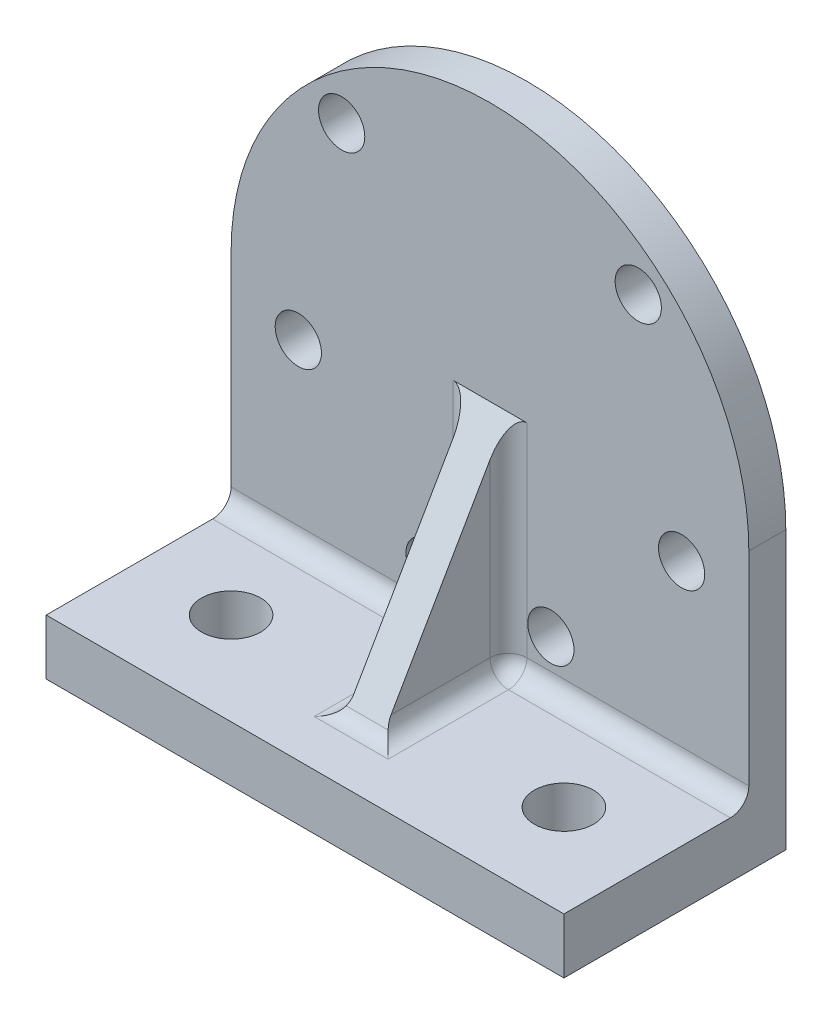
ISO-10303-21;
HEADER;
FILE_DESCRIPTION(('STEP AP214'),'2;1');
FILE_NAME('part.step','',(''),(''),'','','');
FILE_SCHEMA(('AUTOMOTIVE_DESIGN { 1 0 10303 214 1 1 1 1 }'));
ENDSEC;
DATA;
#1=APPLICATION_CONTEXT('core data for automotive mechanical design processes');
#2=APPLICATION_PROTOCOL_DEFINITION('international standard','automotive_design',2000,#1);
#3=PRODUCT_CONTEXT('',#1,'mechanical');
#4=PRODUCT('Part','Part','',(#3));
#5=PRODUCT_RELATED_PRODUCT_CATEGORY('part','',(#4));
#6=PRODUCT_DEFINITION_FORMATION('','',#4);
#7=PRODUCT_DEFINITION_CONTEXT('part definition',#1,'design');
#8=PRODUCT_DEFINITION('design','',#6,#7);
#9=PRODUCT_DEFINITION_SHAPE('','',#8);
#10=(LENGTH_UNIT() NAMED_UNIT(*) SI_UNIT(.MILLI.,.METRE.));
#11=(NAMED_UNIT(*) PLANE_ANGLE_UNIT() SI_UNIT($,.RADIAN.));
#12=(NAMED_UNIT(*) SI_UNIT($,.STERADIAN.) SOLID_ANGLE_UNIT());
#13=UNCERTAINTY_MEASURE_WITH_UNIT(LENGTH_MEASURE(1.E-05),#10,'distance_accuracy_value','');
#14=(GEOMETRIC_REPRESENTATION_CONTEXT(3) GLOBAL_UNCERTAINTY_ASSIGNED_CONTEXT((#13)) GLOBAL_UNIT_ASSIGNED_CONTEXT((#10,
#11,#12)) REPRESENTATION_CONTEXT('',''));
#15=CARTESIAN_POINT('',(0.,0.,0.));
#16=DIRECTION('',(0.,0.,1.));
#17=DIRECTION('',(1.,0.,0.));
#18=AXIS2_PLACEMENT_3D('',#15,#16,#17);
#19=CARTESIAN_POINT('',(0.,-12.,3.));
#20=DIRECTION('',(-1.,0.,0.));
#21=DIRECTION('',(0.,0.,1.));
#22=AXIS2_PLACEMENT_3D('',#19,#20,#21);
#23=CYLINDRICAL_SURFACE('',#22,1.);
#24=DIRECTION('',(1.,0.,0.));
#25=VECTOR('',#24,1.);
#26=CARTESIAN_POINT('',(-14.,-13.,3.));
#27=LINE('',#26,#25);
#28=CARTESIAN_POINT('',(-2.,-13.,3.));
#29=VERTEX_POINT('',#28);
#30=CARTESIAN_POINT('',(-14.,-13.,3.));
#31=VERTEX_POINT('',#30);
#32=EDGE_CURVE('E226',#29,#31,#27,.F.);
#33=ORIENTED_EDGE('',*,*,#32,.F.);
#34=CARTESIAN_POINT('',(-2.,-12.,3.));
#35=DIRECTION('',(-1.,0.,0.));
#36=DIRECTION('',(0.,0.,1.));
#37=AXIS2_PLACEMENT_3D('',#34,#35,#36);
#38=CIRCLE('',#37,1.);
#39=CARTESIAN_POINT('',(-2.,-12.,2.));
#40=VERTEX_POINT('',#39);
#41=EDGE_CURVE('E251',#29,#40,#38,.F.);
#42=ORIENTED_EDGE('',*,*,#41,.T.);
#43=DIRECTION('',(1.,0.,0.));
#44=VECTOR('',#43,1.);
#45=CARTESIAN_POINT('',(14.,-12.,2.));
#46=LINE('',#45,#44);
#47=CARTESIAN_POINT('',(-14.,-12.,2.));
#48=VERTEX_POINT('',#47);
#49=EDGE_CURVE('E223',#48,#40,#46,.T.);
#50=ORIENTED_EDGE('',*,*,#49,.F.);
#51=CARTESIAN_POINT('',(-14.,-12.,3.));
#52=DIRECTION('',(1.,0.,0.));
#53=DIRECTION('',(0.,1.,0.));
#54=AXIS2_PLACEMENT_3D('',#51,#52,#53);
#55=CIRCLE('',#54,1.);
#56=EDGE_CURVE('E232',#31,#48,#55,.T.);
#57=ORIENTED_EDGE('',*,*,#56,.F.);
#58=EDGE_LOOP('',(#33,#42,#50,#57));
#59=FACE_BOUND('',#58,.T.);
#60=ADVANCED_FACE('F56',(#59),#23,.F.);
#61=CARTESIAN_POINT('',(0.,0.,2.));
#62=DIRECTION('',(0.,0.,1.));
#63=DIRECTION('',(1.,0.,0.));
#64=AXIS2_PLACEMENT_3D('',#61,#62,#63);
#65=PLANE('',#64);
#66=DIRECTION('',(1.,0.,0.));
#67=VECTOR('',#66,1.);
#68=CARTESIAN_POINT('',(0.,-1.00000000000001,2.));
#69=LINE('',#68,#67);
#70=CARTESIAN_POINT('',(2.,-1.00000000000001,2.));
#71=VERTEX_POINT('',#70);
#72=CARTESIAN_POINT('',(-2.,-1.00000000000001,2.));
#73=VERTEX_POINT('',#72);
#74=EDGE_CURVE('E292',#71,#73,#69,.F.);
#75=ORIENTED_EDGE('',*,*,#74,.F.);
#76=DIRECTION('',(0.,1.,0.));
#77=VECTOR('',#76,1.);
#78=CARTESIAN_POINT('',(2.,-12.,2.));
#79=LINE('',#78,#77);
#80=CARTESIAN_POINT('',(2.,-12.,2.));
#81=VERTEX_POINT('',#80);
#82=EDGE_CURVE('E257',#71,#81,#79,.F.);
#83=ORIENTED_EDGE('',*,*,#82,.T.);
#84=CARTESIAN_POINT('',(14.,-12.,2.));
#85=VERTEX_POINT('',#84);
#86=EDGE_CURVE('E221',#81,#85,#46,.T.);
#87=ORIENTED_EDGE('',*,*,#86,.T.);
#88=DIRECTION('',(0.,1.,0.));
#89=VECTOR('',#88,1.);
#90=CARTESIAN_POINT('',(14.,13.,2.));
#91=LINE('',#90,#89);
#92=CARTESIAN_POINT('',(14.,-1.,2.));
#93=VERTEX_POINT('',#92);
#94=EDGE_CURVE('E172',#85,#93,#91,.T.);
#95=ORIENTED_EDGE('',*,*,#94,.T.);
#96=CARTESIAN_POINT('',(0.,-1.00000000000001,2.));
#97=DIRECTION('',(0.,0.,1.));
#98=DIRECTION('',(1.,0.,0.));
#99=AXIS2_PLACEMENT_3D('',#96,#97,#98);
#100=CIRCLE('',#99,14.);
#101=CARTESIAN_POINT('',(-14.,-1.00000000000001,2.));
#102=VERTEX_POINT('',#101);
#103=EDGE_CURVE('E211',#93,#102,#100,.T.);
#104=ORIENTED_EDGE('',*,*,#103,.T.);
#105=DIRECTION('',(0.,-1.,0.));
#106=VECTOR('',#105,1.);
#107=CARTESIAN_POINT('',(-14.,13.,2.));
#108=LINE('',#107,#106);
#109=EDGE_CURVE('E218',#102,#48,#108,.T.);
#110=ORIENTED_EDGE('',*,*,#109,.T.);
#111=ORIENTED_EDGE('',*,*,#49,.T.);
#112=DIRECTION('',(0.,1.,0.));
#113=VECTOR('',#112,1.);
#114=CARTESIAN_POINT('',(-2.,0.,2.));
#115=LINE('',#114,#113);
#116=EDGE_CURVE('E254',#40,#73,#115,.T.);
#117=ORIENTED_EDGE('',*,*,#116,.T.);
#118=EDGE_LOOP('',(#75,#83,#87,#95,#104,#110,#111,#117));
#119=FACE_BOUND('',#118,.T.);
#120=CARTESIAN_POINT('',(8.02010101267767,8.02010101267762,2.));
#121=DIRECTION('',(0.,0.,1.));
#122=DIRECTION('',(1.,0.,0.));
#123=AXIS2_PLACEMENT_3D('',#120,#121,#122);
#124=CIRCLE('',#123,1.24999999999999);
#125=CARTESIAN_POINT('',(9.27010101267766,8.02010101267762,2.));
#126=VERTEX_POINT('',#125);
#127=EDGE_CURVE('E323',#126,#126,#124,.T.);
#128=ORIENTED_EDGE('',*,*,#127,.F.);
#129=EDGE_LOOP('',(#128));
#130=FACE_BOUND('',#129,.T.);
#131=CARTESIAN_POINT('',(-10.3646752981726,-3.29360748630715,2.));
#132=DIRECTION('',(0.,0.,1.));
#133=DIRECTION('',(1.,0.,0.));
#134=AXIS2_PLACEMENT_3D('',#131,#132,#133);
#135=CIRCLE('',#134,1.24999999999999);
#136=CARTESIAN_POINT('',(-9.11467529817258,-3.29360748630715,2.));
#137=VERTEX_POINT('',#136);
#138=EDGE_CURVE('E320',#137,#137,#135,.T.);
#139=ORIENTED_EDGE('',*,*,#138,.F.);
#140=EDGE_LOOP('',(#139));
#141=FACE_BOUND('',#140,.T.);
#142=CARTESIAN_POINT('',(3.2936074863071,-10.3646752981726,2.));
#143=DIRECTION('',(0.,0.,1.));
#144=DIRECTION('',(1.,0.,0.));
#145=AXIS2_PLACEMENT_3D('',#142,#143,#144);
#146=CIRCLE('',#145,1.24999999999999);
#147=CARTESIAN_POINT('',(4.54360748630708,-10.3646752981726,2.));
#148=VERTEX_POINT('',#147);
#149=EDGE_CURVE('E317',#148,#148,#146,.T.);
#150=ORIENTED_EDGE('',*,*,#149,.F.);
#151=EDGE_LOOP('',(#150));
#152=FACE_BOUND('',#151,.T.);
#153=CARTESIAN_POINT('',(10.3646752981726,-3.29360748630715,2.));
#154=DIRECTION('',(0.,0.,1.));
#155=DIRECTION('',(1.,0.,0.));
#156=AXIS2_PLACEMENT_3D('',#153,#154,#155);
#157=CIRCLE('',#156,1.24999999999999);
#158=CARTESIAN_POINT('',(11.6146752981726,-3.29360748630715,2.));
#159=VERTEX_POINT('',#158);
#160=EDGE_CURVE('E314',#159,#159,#157,.T.);
#161=ORIENTED_EDGE('',*,*,#160,.F.);
#162=EDGE_LOOP('',(#161));
#163=FACE_BOUND('',#162,.T.);
#164=CARTESIAN_POINT('',(-8.02010101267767,8.02010101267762,2.));
#165=DIRECTION('',(0.,0.,1.));
#166=DIRECTION('',(1.,0.,0.));
#167=AXIS2_PLACEMENT_3D('',#164,#165,#166);
#168=CIRCLE('',#167,1.24999999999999);
#169=CARTESIAN_POINT('',(-6.77010101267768,8.02010101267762,2.));
#170=VERTEX_POINT('',#169);
#171=EDGE_CURVE('E309',#170,#170,#168,.T.);
#172=ORIENTED_EDGE('',*,*,#171,.F.);
#173=EDGE_LOOP('',(#172));
#174=FACE_BOUND('',#173,.T.);
#175=CARTESIAN_POINT('',(-3.2936074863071,-10.3646752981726,2.));
#176=DIRECTION('',(0.,0.,1.));
#177=DIRECTION('',(1.,0.,0.));
#178=AXIS2_PLACEMENT_3D('',#175,#176,#177);
#179=CIRCLE('',#178,1.24999999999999);
#180=CARTESIAN_POINT('',(-2.04360748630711,-10.3646752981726,2.));
#181=VERTEX_POINT('',#180);
#182=EDGE_CURVE('E329',#181,#181,#179,.T.);
#183=ORIENTED_EDGE('',*,*,#182,.F.);
#184=EDGE_LOOP('',(#183));
#185=FACE_BOUND('',#184,.T.);
#186=ADVANCED_FACE('F363',(#119,#130,#141,#152,#163,#174,#185),#65,.T.);
#187=CARTESIAN_POINT('',(0.,0.,0.));
#188=DIRECTION('',(0.,0.,1.));
#189=DIRECTION('',(1.,0.,0.));
#190=AXIS2_PLACEMENT_3D('',#187,#188,#189);
#191=PLANE('',#190);
#192=CARTESIAN_POINT('',(8.02010101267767,8.02010101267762,0.));
#193=DIRECTION('',(0.,0.,-1.));
#194=DIRECTION('',(1.,0.,0.));
#195=AXIS2_PLACEMENT_3D('',#192,#193,#194);
#196=CIRCLE('',#195,1.24999999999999);
#197=CARTESIAN_POINT('',(9.27010101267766,8.02010101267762,0.));
#198=VERTEX_POINT('',#197);
#199=EDGE_CURVE('E296',#198,#198,#196,.T.);
#200=ORIENTED_EDGE('',*,*,#199,.F.);
#201=EDGE_LOOP('',(#200));
#202=FACE_BOUND('',#201,.T.);
#203=CARTESIAN_POINT('',(-10.3646752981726,-3.29360748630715,0.));
#204=DIRECTION('',(0.,0.,-1.));
#205=DIRECTION('',(1.,0.,0.));
#206=AXIS2_PLACEMENT_3D('',#203,#204,#205);
#207=CIRCLE('',#206,1.24999999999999);
#208=CARTESIAN_POINT('',(-9.11467529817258,-3.29360748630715,0.));
#209=VERTEX_POINT('',#208);
#210=EDGE_CURVE('E301',#209,#209,#207,.T.);
#211=ORIENTED_EDGE('',*,*,#210,.F.);
#212=EDGE_LOOP('',(#211));
#213=FACE_BOUND('',#212,.T.);
#214=CARTESIAN_POINT('',(3.2936074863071,-10.3646752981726,0.));
#215=DIRECTION('',(0.,0.,-1.));
#216=DIRECTION('',(-1.,0.,0.));
#217=AXIS2_PLACEMENT_3D('',#214,#215,#216);
#218=CIRCLE('',#217,1.24999999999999);
#219=CARTESIAN_POINT('',(2.04360748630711,-10.3646752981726,0.));
#220=VERTEX_POINT('',#219);
#221=EDGE_CURVE('E297',#220,#220,#218,.T.);
#222=ORIENTED_EDGE('',*,*,#221,.F.);
#223=EDGE_LOOP('',(#222));
#224=FACE_BOUND('',#223,.T.);
#225=CARTESIAN_POINT('',(10.3646752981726,-3.29360748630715,0.));
#226=DIRECTION('',(0.,0.,-1.));
#227=DIRECTION('',(-1.,0.,0.));
#228=AXIS2_PLACEMENT_3D('',#225,#226,#227);
#229=CIRCLE('',#228,1.24999999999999);
#230=CARTESIAN_POINT('',(9.11467529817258,-3.29360748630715,0.));
#231=VERTEX_POINT('',#230);
#232=EDGE_CURVE('E300',#231,#231,#229,.T.);
#233=ORIENTED_EDGE('',*,*,#232,.F.);
#234=EDGE_LOOP('',(#233));
#235=FACE_BOUND('',#234,.T.);
#236=CARTESIAN_POINT('',(-8.02010101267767,8.02010101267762,0.));
#237=DIRECTION('',(0.,0.,-1.));
#238=DIRECTION('',(-1.,0.,0.));
#239=AXIS2_PLACEMENT_3D('',#236,#237,#238);
#240=CIRCLE('',#239,1.24999999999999);
#241=CARTESIAN_POINT('',(-9.27010101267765,8.02010101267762,0.));
#242=VERTEX_POINT('',#241);
#243=EDGE_CURVE('E306',#242,#242,#240,.T.);
#244=ORIENTED_EDGE('',*,*,#243,.F.);
#245=EDGE_LOOP('',(#244));
#246=FACE_BOUND('',#245,.T.);
#247=CARTESIAN_POINT('',(-3.2936074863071,-10.3646752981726,0.));
#248=DIRECTION('',(0.,0.,-1.));
#249=DIRECTION('',(1.,0.,0.));
#250=AXIS2_PLACEMENT_3D('',#247,#248,#249);
#251=CIRCLE('',#250,1.24999999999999);
#252=CARTESIAN_POINT('',(-2.04360748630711,-10.3646752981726,0.));
#253=VERTEX_POINT('',#252);
#254=EDGE_CURVE('E326',#253,#253,#251,.T.);
#255=ORIENTED_EDGE('',*,*,#254,.F.);
#256=EDGE_LOOP('',(#255));
#257=FACE_BOUND('',#256,.T.);
#258=DIRECTION('',(0.,1.,0.));
#259=VECTOR('',#258,1.);
#260=CARTESIAN_POINT('',(14.,13.,0.));
#261=LINE('',#260,#259);
#262=CARTESIAN_POINT('',(14.,-16.,0.));
#263=VERTEX_POINT('',#262);
#264=CARTESIAN_POINT('',(14.,-1.,0.));
#265=VERTEX_POINT('',#264);
#266=EDGE_CURVE('E173',#263,#265,#261,.T.);
#267=ORIENTED_EDGE('',*,*,#266,.F.);
#268=DIRECTION('',(1.,0.,0.));
#269=VECTOR('',#268,1.);
#270=CARTESIAN_POINT('',(-14.,-16.,0.));
#271=LINE('',#270,#269);
#272=CARTESIAN_POINT('',(-14.,-16.,0.));
#273=VERTEX_POINT('',#272);
#274=EDGE_CURVE('E176',#273,#263,#271,.T.);
#275=ORIENTED_EDGE('',*,*,#274,.F.);
#276=DIRECTION('',(0.,-1.,0.));
#277=VECTOR('',#276,1.);
#278=CARTESIAN_POINT('',(-14.,13.,0.));
#279=LINE('',#278,#277);
#280=CARTESIAN_POINT('',(-14.,-1.00000000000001,0.));
#281=VERTEX_POINT('',#280);
#282=EDGE_CURVE('E163',#281,#273,#279,.T.);
#283=ORIENTED_EDGE('',*,*,#282,.F.);
#284=CARTESIAN_POINT('',(0.,-1.00000000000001,0.));
#285=DIRECTION('',(0.,0.,1.));
#286=DIRECTION('',(1.,0.,0.));
#287=AXIS2_PLACEMENT_3D('',#284,#285,#286);
#288=CIRCLE('',#287,14.);
#289=EDGE_CURVE('E212',#265,#281,#288,.T.);
#290=ORIENTED_EDGE('',*,*,#289,.F.);
#291=EDGE_LOOP('',(#267,#275,#283,#290));
#292=FACE_BOUND('',#291,.T.);
#293=ADVANCED_FACE('F177',(#202,#213,#224,#235,#246,#257,#292),#191,.F.);
#294=CARTESIAN_POINT('',(-14.,13.,2.));
#295=DIRECTION('',(1.,0.,0.));
#296=DIRECTION('',(0.,1.,0.));
#297=AXIS2_PLACEMENT_3D('',#294,#295,#296);
#298=PLANE('',#297);
#299=DIRECTION('',(0.,0.,1.));
#300=VECTOR('',#299,1.);
#301=CARTESIAN_POINT('',(-14.,-1.00000000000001,0.));
#302=LINE('',#301,#300);
#303=EDGE_CURVE('E170',#281,#102,#302,.T.);
#304=ORIENTED_EDGE('',*,*,#303,.F.);
#305=ORIENTED_EDGE('',*,*,#282,.T.);
#306=DIRECTION('',(0.,0.,-1.));
#307=VECTOR('',#306,1.);
#308=CARTESIAN_POINT('',(-14.,-16.,0.));
#309=LINE('',#308,#307);
#310=CARTESIAN_POINT('',(-14.,-16.,12.));
#311=VERTEX_POINT('',#310);
#312=EDGE_CURVE('E168',#311,#273,#309,.T.);
#313=ORIENTED_EDGE('',*,*,#312,.F.);
#314=DIRECTION('',(0.,1.,0.));
#315=VECTOR('',#314,1.);
#316=CARTESIAN_POINT('',(-14.,-16.,12.));
#317=LINE('',#316,#315);
#318=CARTESIAN_POINT('',(-14.,-13.,12.));
#319=VERTEX_POINT('',#318);
#320=EDGE_CURVE('E198',#311,#319,#317,.T.);
#321=ORIENTED_EDGE('',*,*,#320,.T.);
#322=DIRECTION('',(0.,0.,-1.));
#323=VECTOR('',#322,1.);
#324=CARTESIAN_POINT('',(-14.,-13.,0.));
#325=LINE('',#324,#323);
#326=EDGE_CURVE('E199',#319,#31,#325,.T.);
#327=ORIENTED_EDGE('',*,*,#326,.T.);
#328=ORIENTED_EDGE('',*,*,#56,.T.);
#329=ORIENTED_EDGE('',*,*,#109,.F.);
#330=EDGE_LOOP('',(#304,#305,#313,#321,#327,#328,#329));
#331=FACE_BOUND('',#330,.T.);
#332=ADVANCED_FACE('F165',(#331),#298,.F.);
#333=CARTESIAN_POINT('',(14.,13.,2.));
#334=DIRECTION('',(-1.,0.,0.));
#335=DIRECTION('',(0.,-1.,0.));
#336=AXIS2_PLACEMENT_3D('',#333,#334,#335);
#337=PLANE('',#336);
#338=ORIENTED_EDGE('',*,*,#266,.T.);
#339=DIRECTION('',(0.,0.,1.));
#340=VECTOR('',#339,1.);
#341=CARTESIAN_POINT('',(14.,-1.,0.));
#342=LINE('',#341,#340);
#343=EDGE_CURVE('E208',#265,#93,#342,.T.);
#344=ORIENTED_EDGE('',*,*,#343,.T.);
#345=ORIENTED_EDGE('',*,*,#94,.F.);
#346=CARTESIAN_POINT('',(14.,-12.,3.));
#347=DIRECTION('',(-1.,0.,0.));
#348=DIRECTION('',(0.,-1.,0.));
#349=AXIS2_PLACEMENT_3D('',#346,#347,#348);
#350=CIRCLE('',#349,1.);
#351=CARTESIAN_POINT('',(14.,-13.,3.));
#352=VERTEX_POINT('',#351);
#353=EDGE_CURVE('E230',#85,#352,#350,.T.);
#354=ORIENTED_EDGE('',*,*,#353,.T.);
#355=DIRECTION('',(0.,0.,1.));
#356=VECTOR('',#355,1.);
#357=CARTESIAN_POINT('',(14.,-13.,0.));
#358=LINE('',#357,#356);
#359=CARTESIAN_POINT('',(14.,-13.,12.));
#360=VERTEX_POINT('',#359);
#361=EDGE_CURVE('E190',#352,#360,#358,.T.);
#362=ORIENTED_EDGE('',*,*,#361,.T.);
#363=DIRECTION('',(0.,1.,0.));
#364=VECTOR('',#363,1.);
#365=CARTESIAN_POINT('',(14.,-16.,12.));
#366=LINE('',#365,#364);
#367=CARTESIAN_POINT('',(14.,-16.,12.));
#368=VERTEX_POINT('',#367);
#369=EDGE_CURVE('E205',#368,#360,#366,.T.);
#370=ORIENTED_EDGE('',*,*,#369,.F.);
#371=DIRECTION('',(0.,0.,1.));
#372=VECTOR('',#371,1.);
#373=CARTESIAN_POINT('',(14.,-16.,0.));
#374=LINE('',#373,#372);
#375=EDGE_CURVE('E181',#263,#368,#374,.T.);
#376=ORIENTED_EDGE('',*,*,#375,.F.);
#377=EDGE_LOOP('',(#338,#344,#345,#354,#362,#370,#376));
#378=FACE_BOUND('',#377,.T.);
#379=ADVANCED_FACE('F357',(#378),#337,.F.);
#380=CARTESIAN_POINT('',(0.,-1.00000000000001,0.));
#381=DIRECTION('',(0.,0.,1.));
#382=DIRECTION('',(1.,0.,0.));
#383=AXIS2_PLACEMENT_3D('',#380,#381,#382);
#384=CYLINDRICAL_SURFACE('',#383,14.);
#385=ORIENTED_EDGE('',*,*,#103,.F.);
#386=ORIENTED_EDGE('',*,*,#343,.F.);
#387=ORIENTED_EDGE('',*,*,#289,.T.);
#388=ORIENTED_EDGE('',*,*,#303,.T.);
#389=EDGE_LOOP('',(#385,#386,#387,#388));
#390=FACE_BOUND('',#389,.T.);
#391=ADVANCED_FACE('F348',(#390),#384,.T.);
#392=CARTESIAN_POINT('',(0.,-13.,0.));
#393=DIRECTION('',(0.,1.,0.));
#394=DIRECTION('',(0.,0.,1.));
#395=AXIS2_PLACEMENT_3D('',#392,#393,#394);
#396=PLANE('',#395);
#397=CARTESIAN_POINT('',(2.,-13.,3.));
#398=VERTEX_POINT('',#397);
#399=EDGE_CURVE('E227',#352,#398,#27,.F.);
#400=ORIENTED_EDGE('',*,*,#399,.T.);
#401=DIRECTION('',(0.,0.,-1.));
#402=VECTOR('',#401,1.);
#403=CARTESIAN_POINT('',(2.,-13.,8.92820323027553));
#404=LINE('',#403,#402);
#405=CARTESIAN_POINT('',(2.,-13.,9.50555349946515));
#406=VERTEX_POINT('',#405);
#407=EDGE_CURVE('E243',#398,#406,#404,.F.);
#408=ORIENTED_EDGE('',*,*,#407,.T.);
#409=DIRECTION('',(-1.,0.,0.));
#410=VECTOR('',#409,1.);
#411=CARTESIAN_POINT('',(-0.999999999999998,-13.,9.50555349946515));
#412=LINE('',#411,#410);
#413=CARTESIAN_POINT('',(-2.,-13.,9.50555349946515));
#414=VERTEX_POINT('',#413);
#415=EDGE_CURVE('E239',#406,#414,#412,.T.);
#416=ORIENTED_EDGE('',*,*,#415,.T.);
#417=DIRECTION('',(0.,0.,-1.));
#418=VECTOR('',#417,1.);
#419=CARTESIAN_POINT('',(-2.,-13.,0.));
#420=LINE('',#419,#418);
#421=EDGE_CURVE('E241',#414,#29,#420,.T.);
#422=ORIENTED_EDGE('',*,*,#421,.T.);
#423=ORIENTED_EDGE('',*,*,#32,.T.);
#424=ORIENTED_EDGE('',*,*,#326,.F.);
#425=DIRECTION('',(-1.,0.,0.));
#426=VECTOR('',#425,1.);
#427=CARTESIAN_POINT('',(-14.,-13.,12.));
#428=LINE('',#427,#426);
#429=EDGE_CURVE('E188',#360,#319,#428,.T.);
#430=ORIENTED_EDGE('',*,*,#429,.F.);
#431=ORIENTED_EDGE('',*,*,#361,.F.);
#432=EDGE_LOOP('',(#400,#408,#416,#422,#423,#424,#430,#431));
#433=FACE_BOUND('',#432,.T.);
#434=CARTESIAN_POINT('',(9.,-13.,7.));
#435=DIRECTION('',(0.,1.,0.));
#436=DIRECTION('',(0.,0.,1.));
#437=AXIS2_PLACEMENT_3D('',#434,#435,#436);
#438=CIRCLE('',#437,1.6);
#439=CARTESIAN_POINT('',(9.,-13.,8.6));
#440=VERTEX_POINT('',#439);
#441=EDGE_CURVE('E332',#440,#440,#438,.T.);
#442=ORIENTED_EDGE('',*,*,#441,.F.);
#443=EDGE_LOOP('',(#442));
#444=FACE_BOUND('',#443,.T.);
#445=CARTESIAN_POINT('',(-9.,-13.,7.));
#446=DIRECTION('',(0.,1.,0.));
#447=DIRECTION('',(0.,0.,1.));
#448=AXIS2_PLACEMENT_3D('',#445,#446,#447);
#449=CIRCLE('',#448,1.6);
#450=CARTESIAN_POINT('',(-9.,-13.,8.6));
#451=VERTEX_POINT('',#450);
#452=EDGE_CURVE('E193',#451,#451,#449,.T.);
#453=ORIENTED_EDGE('',*,*,#452,.F.);
#454=EDGE_LOOP('',(#453));
#455=FACE_BOUND('',#454,.T.);
#456=ADVANCED_FACE('F345',(#433,#444,#455),#396,.T.);
#457=CARTESIAN_POINT('',(-14.,-16.,12.));
#458=DIRECTION('',(0.,0.,-1.));
#459=DIRECTION('',(-1.,0.,0.));
#460=AXIS2_PLACEMENT_3D('',#457,#458,#459);
#461=PLANE('',#460);
#462=ORIENTED_EDGE('',*,*,#429,.T.);
#463=ORIENTED_EDGE('',*,*,#320,.F.);
#464=DIRECTION('',(-1.,0.,0.));
#465=VECTOR('',#464,1.);
#466=CARTESIAN_POINT('',(-14.,-16.,12.));
#467=LINE('',#466,#465);
#468=EDGE_CURVE('E186',#368,#311,#467,.T.);
#469=ORIENTED_EDGE('',*,*,#468,.F.);
#470=ORIENTED_EDGE('',*,*,#369,.T.);
#471=EDGE_LOOP('',(#462,#463,#469,#470));
#472=FACE_BOUND('',#471,.T.);
#473=ADVANCED_FACE('F347',(#472),#461,.F.);
#474=CARTESIAN_POINT('',(0.,-16.,0.));
#475=DIRECTION('',(0.,1.,0.));
#476=DIRECTION('',(0.,0.,1.));
#477=AXIS2_PLACEMENT_3D('',#474,#475,#476);
#478=PLANE('',#477);
#479=ORIENTED_EDGE('',*,*,#274,.T.);
#480=ORIENTED_EDGE('',*,*,#375,.T.);
#481=ORIENTED_EDGE('',*,*,#468,.T.);
#482=ORIENTED_EDGE('',*,*,#312,.T.);
#483=EDGE_LOOP('',(#479,#480,#481,#482));
#484=FACE_BOUND('',#483,.T.);
#485=CARTESIAN_POINT('',(9.,-16.,7.));
#486=DIRECTION('',(0.,1.,0.));
#487=DIRECTION('',(0.,0.,1.));
#488=AXIS2_PLACEMENT_3D('',#485,#486,#487);
#489=CIRCLE('',#488,1.6);
#490=CARTESIAN_POINT('',(9.,-16.,8.6));
#491=VERTEX_POINT('',#490);
#492=EDGE_CURVE('E333',#491,#491,#489,.T.);
#493=ORIENTED_EDGE('',*,*,#492,.T.);
#494=EDGE_LOOP('',(#493));
#495=FACE_BOUND('',#494,.T.);
#496=CARTESIAN_POINT('',(-9.,-16.,7.));
#497=DIRECTION('',(0.,1.,0.));
#498=DIRECTION('',(0.,0.,1.));
#499=AXIS2_PLACEMENT_3D('',#496,#497,#498);
#500=CIRCLE('',#499,1.6);
#501=CARTESIAN_POINT('',(-9.,-16.,8.6));
#502=VERTEX_POINT('',#501);
#503=EDGE_CURVE('E202',#502,#502,#500,.T.);
#504=ORIENTED_EDGE('',*,*,#503,.T.);
#505=EDGE_LOOP('',(#504));
#506=FACE_BOUND('',#505,.T.);
#507=ADVANCED_FACE('F183',(#484,#495,#506),#478,.F.);
#508=ORIENTED_EDGE('',*,*,#86,.F.);
#509=CARTESIAN_POINT('',(2.,-12.,3.));
#510=DIRECTION('',(-1.,0.,0.));
#511=DIRECTION('',(0.,0.,1.));
#512=AXIS2_PLACEMENT_3D('',#509,#510,#511);
#513=CIRCLE('',#512,1.);
#514=EDGE_CURVE('E245',#81,#398,#513,.T.);
#515=ORIENTED_EDGE('',*,*,#514,.T.);
#516=ORIENTED_EDGE('',*,*,#399,.F.);
#517=ORIENTED_EDGE('',*,*,#353,.F.);
#518=EDGE_LOOP('',(#508,#515,#516,#517));
#519=FACE_BOUND('',#518,.T.);
#520=ADVANCED_FACE('F366',(#519),#23,.F.);
#521=CARTESIAN_POINT('',(-9.,-16.,7.));
#522=DIRECTION('',(0.,1.,0.));
#523=DIRECTION('',(0.,0.,1.));
#524=AXIS2_PLACEMENT_3D('',#521,#522,#523);
#525=CYLINDRICAL_SURFACE('',#524,1.6);
#526=ORIENTED_EDGE('',*,*,#503,.F.);
#527=EDGE_LOOP('',(#526));
#528=FACE_BOUND('',#527,.T.);
#529=ORIENTED_EDGE('',*,*,#452,.T.);
#530=EDGE_LOOP('',(#529));
#531=FACE_BOUND('',#530,.T.);
#532=ADVANCED_FACE('F343',(#528,#531),#525,.F.);
#533=CARTESIAN_POINT('',(9.,-16.,7.));
#534=DIRECTION('',(0.,1.,0.));
#535=DIRECTION('',(0.,0.,1.));
#536=AXIS2_PLACEMENT_3D('',#533,#534,#535);
#537=CYLINDRICAL_SURFACE('',#536,1.6);
#538=ORIENTED_EDGE('',*,*,#492,.F.);
#539=EDGE_LOOP('',(#538));
#540=FACE_BOUND('',#539,.T.);
#541=ORIENTED_EDGE('',*,*,#441,.T.);
#542=EDGE_LOOP('',(#541));
#543=FACE_BOUND('',#542,.T.);
#544=ADVANCED_FACE('F381',(#540,#543),#537,.F.);
#545=CARTESIAN_POINT('',(-3.2936074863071,-10.3646752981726,10.));
#546=DIRECTION('',(0.,0.,-1.));
#547=DIRECTION('',(-1.,0.,0.));
#548=AXIS2_PLACEMENT_3D('',#545,#546,#547);
#549=CYLINDRICAL_SURFACE('',#548,1.24999999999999);
#550=ORIENTED_EDGE('',*,*,#182,.T.);
#551=EDGE_LOOP('',(#550));
#552=FACE_BOUND('',#551,.T.);
#553=ORIENTED_EDGE('',*,*,#254,.T.);
#554=EDGE_LOOP('',(#553));
#555=FACE_BOUND('',#554,.T.);
#556=ADVANCED_FACE('F446',(#552,#555),#549,.F.);
#557=CARTESIAN_POINT('',(-8.02010101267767,8.02010101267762,10.));
#558=DIRECTION('',(0.,0.,-1.));
#559=DIRECTION('',(-1.,0.,0.));
#560=AXIS2_PLACEMENT_3D('',#557,#558,#559);
#561=CYLINDRICAL_SURFACE('',#560,1.24999999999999);
#562=ORIENTED_EDGE('',*,*,#171,.T.);
#563=EDGE_LOOP('',(#562));
#564=FACE_BOUND('',#563,.T.);
#565=ORIENTED_EDGE('',*,*,#243,.T.);
#566=EDGE_LOOP('',(#565));
#567=FACE_BOUND('',#566,.T.);
#568=ADVANCED_FACE('F448',(#564,#567),#561,.F.);
#569=CARTESIAN_POINT('',(10.3646752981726,-3.29360748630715,10.));
#570=DIRECTION('',(0.,0.,-1.));
#571=DIRECTION('',(-1.,0.,0.));
#572=AXIS2_PLACEMENT_3D('',#569,#570,#571);
#573=CYLINDRICAL_SURFACE('',#572,1.24999999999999);
#574=ORIENTED_EDGE('',*,*,#160,.T.);
#575=EDGE_LOOP('',(#574));
#576=FACE_BOUND('',#575,.T.);
#577=ORIENTED_EDGE('',*,*,#232,.T.);
#578=EDGE_LOOP('',(#577));
#579=FACE_BOUND('',#578,.T.);
#580=ADVANCED_FACE('F455',(#576,#579),#573,.F.);
#581=CARTESIAN_POINT('',(3.2936074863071,-10.3646752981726,10.));
#582=DIRECTION('',(0.,0.,-1.));
#583=DIRECTION('',(-1.,0.,0.));
#584=AXIS2_PLACEMENT_3D('',#581,#582,#583);
#585=CYLINDRICAL_SURFACE('',#584,1.24999999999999);
#586=ORIENTED_EDGE('',*,*,#149,.T.);
#587=EDGE_LOOP('',(#586));
#588=FACE_BOUND('',#587,.T.);
#589=ORIENTED_EDGE('',*,*,#221,.T.);
#590=EDGE_LOOP('',(#589));
#591=FACE_BOUND('',#590,.T.);
#592=ADVANCED_FACE('F462',(#588,#591),#585,.F.);
#593=CARTESIAN_POINT('',(-10.3646752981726,-3.29360748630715,10.));
#594=DIRECTION('',(0.,0.,-1.));
#595=DIRECTION('',(-1.,0.,0.));
#596=AXIS2_PLACEMENT_3D('',#593,#594,#595);
#597=CYLINDRICAL_SURFACE('',#596,1.24999999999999);
#598=ORIENTED_EDGE('',*,*,#138,.T.);
#599=EDGE_LOOP('',(#598));
#600=FACE_BOUND('',#599,.T.);
#601=ORIENTED_EDGE('',*,*,#210,.T.);
#602=EDGE_LOOP('',(#601));
#603=FACE_BOUND('',#602,.T.);
#604=ADVANCED_FACE('F468',(#600,#603),#597,.F.);
#605=CARTESIAN_POINT('',(8.02010101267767,8.02010101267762,10.));
#606=DIRECTION('',(0.,0.,-1.));
#607=DIRECTION('',(-1.,0.,0.));
#608=AXIS2_PLACEMENT_3D('',#605,#606,#607);
#609=CYLINDRICAL_SURFACE('',#608,1.24999999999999);
#610=ORIENTED_EDGE('',*,*,#127,.T.);
#611=EDGE_LOOP('',(#610));
#612=FACE_BOUND('',#611,.T.);
#613=ORIENTED_EDGE('',*,*,#199,.T.);
#614=EDGE_LOOP('',(#613));
#615=FACE_BOUND('',#614,.T.);
#616=ADVANCED_FACE('F465',(#612,#615),#609,.F.);
#617=CARTESIAN_POINT('',(0.,-13.,8.92820323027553));
#618=DIRECTION('',(0.,-0.500000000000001,-0.866025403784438));
#619=DIRECTION('',(0.,0.866025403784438,-0.500000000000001));
#620=AXIS2_PLACEMENT_3D('',#617,#618,#619);
#621=PLANE('',#620);
#622=CARTESIAN_POINT('',(-2.,-12.,8.3508529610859));
#623=DIRECTION('',(0.,-0.500000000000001,-0.866025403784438));
#624=DIRECTION('',(0.,0.866025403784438,-0.500000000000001));
#625=AXIS2_PLACEMENT_3D('',#622,#623,#624);
#626=ELLIPSE('',#625,1.15470053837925,1.);
#627=CARTESIAN_POINT('',(-0.999999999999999,-12.,8.3508529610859));
#628=VERTEX_POINT('',#627);
#629=CARTESIAN_POINT('',(-1.13397459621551,-12.5,8.63952809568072));
#630=VERTEX_POINT('',#629);
#631=EDGE_CURVE('E261',#628,#630,#626,.T.);
#632=ORIENTED_EDGE('',*,*,#631,.T.);
#633=DIRECTION('',(1.,0.,0.));
#634=VECTOR('',#633,1.);
#635=CARTESIAN_POINT('',(1.,-12.5,8.63952809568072));
#636=LINE('',#635,#634);
#637=CARTESIAN_POINT('',(1.13397459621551,-12.5,8.63952809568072));
#638=VERTEX_POINT('',#637);
#639=EDGE_CURVE('E73',#630,#638,#636,.T.);
#640=ORIENTED_EDGE('',*,*,#639,.T.);
#641=CARTESIAN_POINT('',(2.,-12.,8.3508529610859));
#642=DIRECTION('',(0.,-0.500000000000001,-0.866025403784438));
#643=DIRECTION('',(0.,-0.866025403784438,0.500000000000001));
#644=AXIS2_PLACEMENT_3D('',#641,#642,#643);
#645=ELLIPSE('',#644,1.15470053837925,1.);
#646=CARTESIAN_POINT('',(1.,-12.,8.3508529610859));
#647=VERTEX_POINT('',#646);
#648=EDGE_CURVE('E259',#638,#647,#645,.T.);
#649=ORIENTED_EDGE('',*,*,#648,.T.);
#650=DIRECTION('',(0.,0.866025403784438,-0.500000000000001));
#651=VECTOR('',#650,1.);
#652=CARTESIAN_POINT('',(1.,-13.,8.92820323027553));
#653=LINE('',#652,#651);
#654=CARTESIAN_POINT('',(1.,-2.73205080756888,3.));
#655=VERTEX_POINT('',#654);
#656=EDGE_CURVE('E286',#647,#655,#653,.T.);
#657=ORIENTED_EDGE('',*,*,#656,.T.);
#658=CARTESIAN_POINT('',(2.,-2.73205080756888,3.));
#659=DIRECTION('',(0.,-0.500000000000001,-0.866025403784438));
#660=DIRECTION('',(0.,-0.866025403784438,0.500000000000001));
#661=AXIS2_PLACEMENT_3D('',#658,#659,#660);
#662=ELLIPSE('',#661,1.99999999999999,1.);
#663=EDGE_CURVE('E65',#655,#71,#662,.T.);
#664=ORIENTED_EDGE('',*,*,#663,.T.);
#665=ORIENTED_EDGE('',*,*,#74,.T.);
#666=CARTESIAN_POINT('',(-2.,-2.73205080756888,3.));
#667=DIRECTION('',(0.,-0.500000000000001,-0.866025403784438));
#668=DIRECTION('',(0.,0.866025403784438,-0.500000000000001));
#669=AXIS2_PLACEMENT_3D('',#666,#667,#668);
#670=ELLIPSE('',#669,1.99999999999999,1.);
#671=CARTESIAN_POINT('',(-1.,-2.73205080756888,3.));
#672=VERTEX_POINT('',#671);
#673=EDGE_CURVE('E12',#73,#672,#670,.T.);
#674=ORIENTED_EDGE('',*,*,#673,.T.);
#675=DIRECTION('',(0.,0.866025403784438,-0.500000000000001));
#676=VECTOR('',#675,1.);
#677=CARTESIAN_POINT('',(-0.999999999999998,-13.,8.92820323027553));
#678=LINE('',#677,#676);
#679=EDGE_CURVE('E281',#628,#672,#678,.T.);
#680=ORIENTED_EDGE('',*,*,#679,.F.);
#681=EDGE_LOOP('',(#632,#640,#649,#657,#664,#665,#674,#680));
#682=FACE_BOUND('',#681,.T.);
#683=ADVANCED_FACE('F414',(#682),#621,.F.);
#684=CARTESIAN_POINT('',(1.,-1.5,6.));
#685=DIRECTION('',(1.,0.,0.));
#686=DIRECTION('',(0.,1.,0.));
#687=AXIS2_PLACEMENT_3D('',#684,#685,#686);
#688=PLANE('',#687);
#689=ORIENTED_EDGE('',*,*,#656,.F.);
#690=DIRECTION('',(0.,0.,-1.));
#691=VECTOR('',#690,1.);
#692=CARTESIAN_POINT('',(1.,-12.,3.));
#693=LINE('',#692,#691);
#694=CARTESIAN_POINT('',(1.,-12.,3.));
#695=VERTEX_POINT('',#694);
#696=EDGE_CURVE('E236',#647,#695,#693,.T.);
#697=ORIENTED_EDGE('',*,*,#696,.T.);
#698=DIRECTION('',(0.,1.,0.));
#699=VECTOR('',#698,1.);
#700=CARTESIAN_POINT('',(1.,-1.00000000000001,3.));
#701=LINE('',#700,#699);
#702=EDGE_CURVE('E234',#695,#655,#701,.T.);
#703=ORIENTED_EDGE('',*,*,#702,.T.);
#704=EDGE_LOOP('',(#689,#697,#703));
#705=FACE_BOUND('',#704,.T.);
#706=ADVANCED_FACE('F478',(#705),#688,.T.);
#707=CARTESIAN_POINT('',(-1.,-1.5,6.));
#708=DIRECTION('',(1.,0.,0.));
#709=DIRECTION('',(0.,1.,0.));
#710=AXIS2_PLACEMENT_3D('',#707,#708,#709);
#711=PLANE('',#710);
#712=DIRECTION('',(0.,1.,0.));
#713=VECTOR('',#712,1.);
#714=CARTESIAN_POINT('',(-1.,-1.5,3.));
#715=LINE('',#714,#713);
#716=CARTESIAN_POINT('',(-0.999999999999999,-12.,3.));
#717=VERTEX_POINT('',#716);
#718=EDGE_CURVE('E247',#672,#717,#715,.F.);
#719=ORIENTED_EDGE('',*,*,#718,.T.);
#720=DIRECTION('',(0.,0.,-1.));
#721=VECTOR('',#720,1.);
#722=CARTESIAN_POINT('',(-0.999999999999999,-12.,6.));
#723=LINE('',#722,#721);
#724=EDGE_CURVE('E249',#717,#628,#723,.F.);
#725=ORIENTED_EDGE('',*,*,#724,.T.);
#726=ORIENTED_EDGE('',*,*,#679,.T.);
#727=EDGE_LOOP('',(#719,#725,#726));
#728=FACE_BOUND('',#727,.T.);
#729=ADVANCED_FACE('F413',(#728),#711,.F.);
#730=CARTESIAN_POINT('',(-2.,0.,3.));
#731=DIRECTION('',(0.,1.,0.));
#732=DIRECTION('',(-1.,0.,0.));
#733=AXIS2_PLACEMENT_3D('',#730,#731,#732);
#734=CYLINDRICAL_SURFACE('',#733,1.);
#735=ORIENTED_EDGE('',*,*,#673,.F.);
#736=ORIENTED_EDGE('',*,*,#116,.F.);
#737=CARTESIAN_POINT('',(-2.,-12.,3.));
#738=DIRECTION('',(0.,1.,0.));
#739=DIRECTION('',(0.,0.,1.));
#740=AXIS2_PLACEMENT_3D('',#737,#738,#739);
#741=CIRCLE('',#740,1.);
#742=EDGE_CURVE('E60',#717,#40,#741,.T.);
#743=ORIENTED_EDGE('',*,*,#742,.F.);
#744=ORIENTED_EDGE('',*,*,#718,.F.);
#745=EDGE_LOOP('',(#735,#736,#743,#744));
#746=FACE_BOUND('',#745,.T.);
#747=ADVANCED_FACE('F58',(#746),#734,.F.);
#748=CARTESIAN_POINT('',(-2.,-12.,3.));
#749=DIRECTION('',(1.,0.,0.));
#750=DIRECTION('',(0.,1.,0.));
#751=AXIS2_PLACEMENT_3D('',#748,#749,#750);
#752=SPHERICAL_SURFACE('',#751,1.);
#753=ORIENTED_EDGE('',*,*,#742,.T.);
#754=ORIENTED_EDGE('',*,*,#41,.F.);
#755=CARTESIAN_POINT('',(-2.,-12.,3.));
#756=DIRECTION('',(0.,0.,-1.));
#757=DIRECTION('',(-1.,0.,0.));
#758=AXIS2_PLACEMENT_3D('',#755,#756,#757);
#759=CIRCLE('',#758,1.);
#760=EDGE_CURVE('E274',#717,#29,#759,.T.);
#761=ORIENTED_EDGE('',*,*,#760,.F.);
#762=EDGE_LOOP('',(#753,#754,#761));
#763=FACE_BOUND('',#762,.T.);
#764=ADVANCED_FACE('F412',(#763),#752,.F.);
#765=CARTESIAN_POINT('',(-2.,-12.,0.));
#766=DIRECTION('',(0.,0.,-1.));
#767=DIRECTION('',(-1.,0.,0.));
#768=AXIS2_PLACEMENT_3D('',#765,#766,#767);
#769=CYLINDRICAL_SURFACE('',#768,1.);
#770=ORIENTED_EDGE('',*,*,#760,.T.);
#771=ORIENTED_EDGE('',*,*,#421,.F.);
#772=CARTESIAN_POINT('',(-2.,-12.,9.50555349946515));
#773=DIRECTION('',(0.707106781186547,0.,0.707106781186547));
#774=DIRECTION('',(0.707106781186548,0.,-0.707106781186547));
#775=AXIS2_PLACEMENT_3D('',#772,#773,#774);
#776=ELLIPSE('',#775,1.41421356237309,1.);
#777=EDGE_CURVE('E273',#630,#414,#776,.F.);
#778=ORIENTED_EDGE('',*,*,#777,.F.);
#779=ORIENTED_EDGE('',*,*,#631,.F.);
#780=ORIENTED_EDGE('',*,*,#724,.F.);
#781=EDGE_LOOP('',(#770,#771,#778,#779,#780));
#782=FACE_BOUND('',#781,.T.);
#783=ADVANCED_FACE('F408',(#782),#769,.F.);
#784=CARTESIAN_POINT('',(2.,-1.5,3.));
#785=DIRECTION('',(0.,-1.,0.));
#786=DIRECTION('',(1.,0.,0.));
#787=AXIS2_PLACEMENT_3D('',#784,#785,#786);
#788=CYLINDRICAL_SURFACE('',#787,1.);
#789=ORIENTED_EDGE('',*,*,#663,.F.);
#790=ORIENTED_EDGE('',*,*,#702,.F.);
#791=CARTESIAN_POINT('',(2.,-12.,3.));
#792=DIRECTION('',(0.,1.,0.));
#793=DIRECTION('',(0.,0.,1.));
#794=AXIS2_PLACEMENT_3D('',#791,#792,#793);
#795=CIRCLE('',#794,1.);
#796=EDGE_CURVE('E270',#81,#695,#795,.T.);
#797=ORIENTED_EDGE('',*,*,#796,.F.);
#798=ORIENTED_EDGE('',*,*,#82,.F.);
#799=EDGE_LOOP('',(#789,#790,#797,#798));
#800=FACE_BOUND('',#799,.T.);
#801=ADVANCED_FACE('F394',(#800),#788,.F.);
#802=CARTESIAN_POINT('',(0.,-12.,9.50555349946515));
#803=DIRECTION('',(1.,0.,0.));
#804=DIRECTION('',(0.,0.,-1.));
#805=AXIS2_PLACEMENT_3D('',#802,#803,#804);
#806=CYLINDRICAL_SURFACE('',#805,1.);
#807=ORIENTED_EDGE('',*,*,#777,.T.);
#808=ORIENTED_EDGE('',*,*,#415,.F.);
#809=CARTESIAN_POINT('',(2.,-12.,9.50555349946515));
#810=DIRECTION('',(0.707106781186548,0.,-0.707106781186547));
#811=DIRECTION('',(0.707106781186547,0.,0.707106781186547));
#812=AXIS2_PLACEMENT_3D('',#809,#810,#811);
#813=ELLIPSE('',#812,1.4142135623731,1.);
#814=EDGE_CURVE('E267',#638,#406,#813,.F.);
#815=ORIENTED_EDGE('',*,*,#814,.F.);
#816=ORIENTED_EDGE('',*,*,#639,.F.);
#817=EDGE_LOOP('',(#807,#808,#815,#816));
#818=FACE_BOUND('',#817,.T.);
#819=ADVANCED_FACE('F405',(#818),#806,.F.);
#820=CARTESIAN_POINT('',(2.,-12.,3.));
#821=DIRECTION('',(1.,0.,0.));
#822=DIRECTION('',(0.,1.,0.));
#823=AXIS2_PLACEMENT_3D('',#820,#821,#822);
#824=SPHERICAL_SURFACE('',#823,1.);
#825=ORIENTED_EDGE('',*,*,#514,.F.);
#826=ORIENTED_EDGE('',*,*,#796,.T.);
#827=CARTESIAN_POINT('',(2.,-12.,3.));
#828=DIRECTION('',(0.,0.,-1.));
#829=DIRECTION('',(-1.,0.,0.));
#830=AXIS2_PLACEMENT_3D('',#827,#828,#829);
#831=CIRCLE('',#830,1.);
#832=EDGE_CURVE('E265',#398,#695,#831,.T.);
#833=ORIENTED_EDGE('',*,*,#832,.F.);
#834=EDGE_LOOP('',(#825,#826,#833));
#835=FACE_BOUND('',#834,.T.);
#836=ADVANCED_FACE('F397',(#835),#824,.F.);
#837=CARTESIAN_POINT('',(2.,-12.,6.));
#838=DIRECTION('',(0.,0.,1.));
#839=DIRECTION('',(1.,0.,0.));
#840=AXIS2_PLACEMENT_3D('',#837,#838,#839);
#841=CYLINDRICAL_SURFACE('',#840,1.);
#842=ORIENTED_EDGE('',*,*,#814,.T.);
#843=ORIENTED_EDGE('',*,*,#407,.F.);
#844=ORIENTED_EDGE('',*,*,#832,.T.);
#845=ORIENTED_EDGE('',*,*,#696,.F.);
#846=ORIENTED_EDGE('',*,*,#648,.F.);
#847=EDGE_LOOP('',(#842,#843,#844,#845,#846));
#848=FACE_BOUND('',#847,.T.);
#849=ADVANCED_FACE('F401',(#848),#841,.F.);
#850=CLOSED_SHELL('',(#60,#186,#293,#332,#379,#391,#456,#473,#507,#520,#532,#544,#556,#568,#580,
#592,#604,#616,#683,#706,#729,#747,#764,#783,#801,#819,#836,#849));
#851=MANIFOLD_SOLID_BREP('B2',#850);
#852=ADVANCED_BREP_SHAPE_REPRESENTATION('',(#18,#851),#14);
#853=SHAPE_DEFINITION_REPRESENTATION(#9,#852);
ENDSEC;
END-ISO-10303-21;
